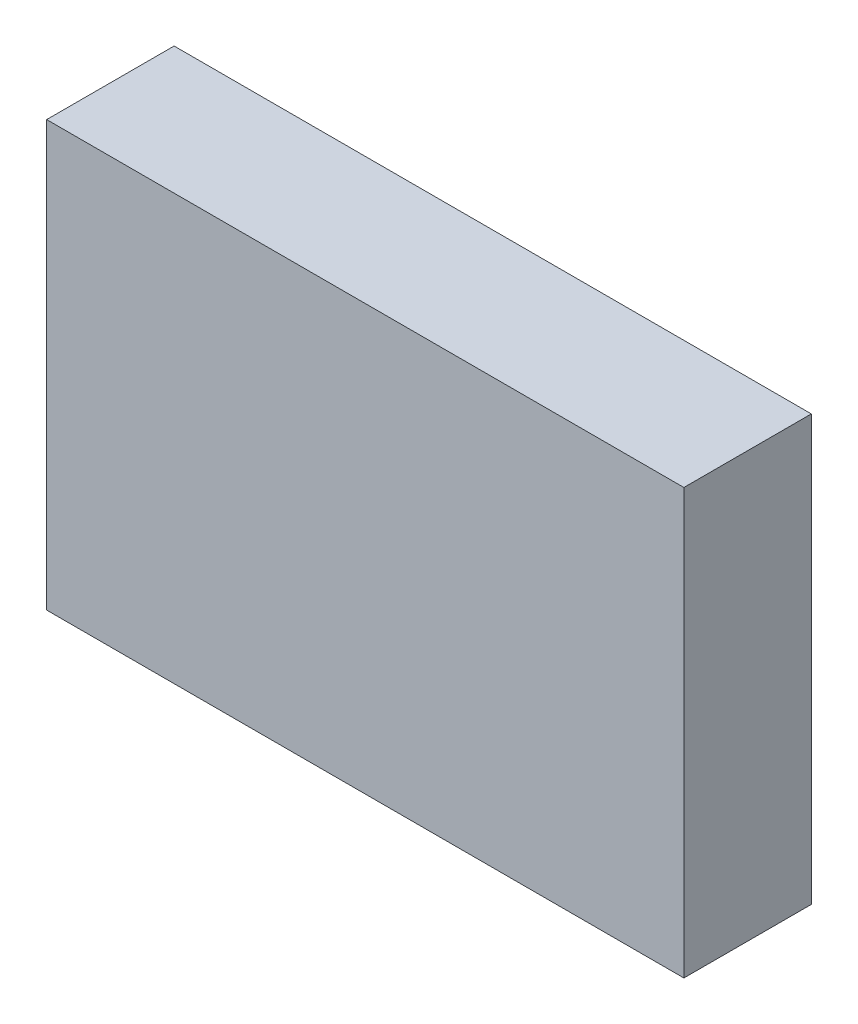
from build123d import *

# Parameters (mm, degrees)
SKIZZE1_W                       = 75
SKIZZE1_H                       = 15
AUFSATZ_LINEAR_AUSTRAGEN1_DEPTH = 50


with BuildPart() as part:
    # Skizze1 → Aufsatz-Linear austragen1 (new body)
    with BuildSketch(Plane(origin=(0, 0, 0), x_dir=(1, 0, 0), z_dir=(0, 1, 0))):
        Rectangle(SKIZZE1_W, SKIZZE1_H)
    extrude(amount=AUFSATZ_LINEAR_AUSTRAGEN1_DEPTH)


solid = part.part
